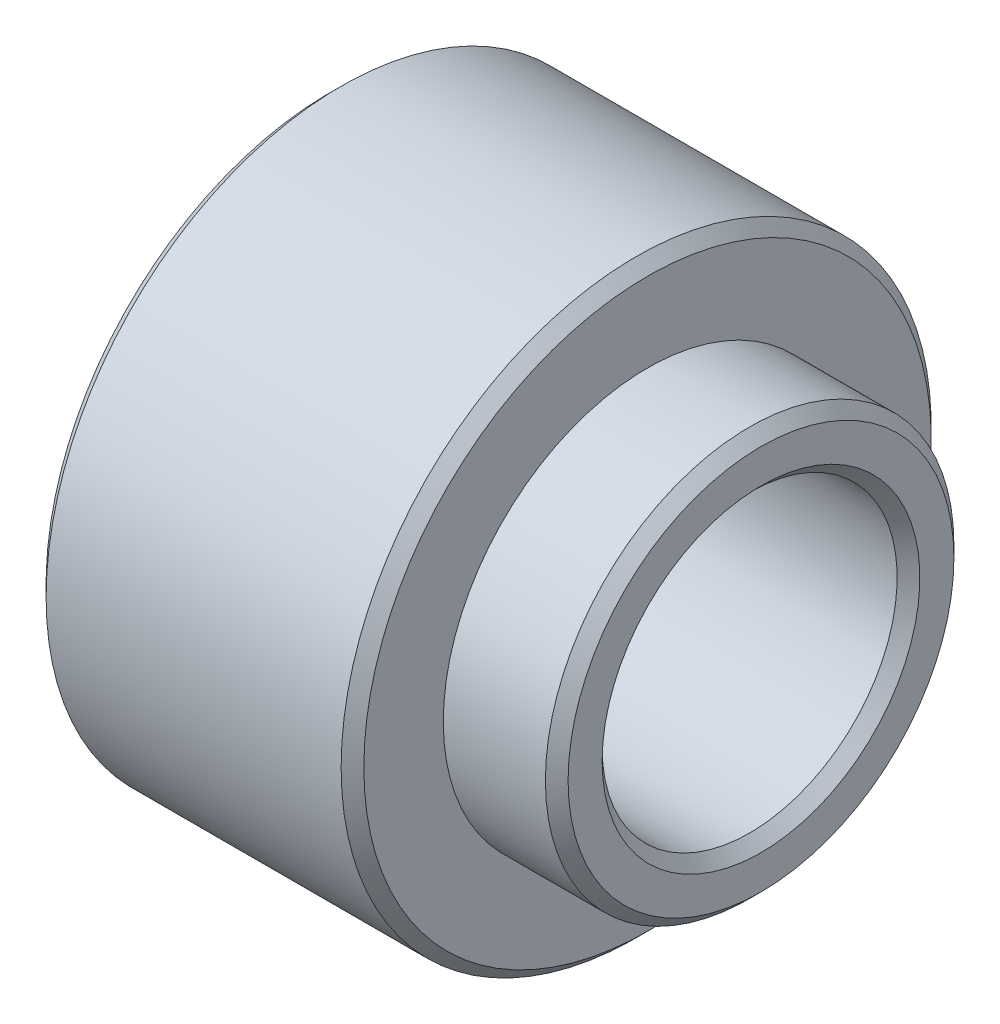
from build123d import *

# Parameters (mm, degrees)
CHAMFER1_SIZE = 0.5


with BuildPart() as part:
    # Sketch1 → Revolve1 (revolve)
    with BuildSketch(Plane.XY, mode=Mode.PRIVATE) as revolve1_sk:
        Polygon((0, 11), (7.794228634, 6.5), (19, 6.5), (19, 9), (14, 9), (14, 13), (0, 13), align=None)
    revolve(revolve1_sk.sketch.rotate(Axis((0, 0, 0), (1, 0, 0)), 90), axis=Axis((0, 0, 0), (1, 0, 0)))

    # Chamfer1
    chamfer1_edges = [part.edges().sort_by_distance(p)[0] for p in [
        (0, 0, -13),
        (14, 0, -13),
        (19, 0, -9),
        (19, 0, -6.5),
    ]]
    chamfer(chamfer1_edges, length=CHAMFER1_SIZE)


solid = part.part
